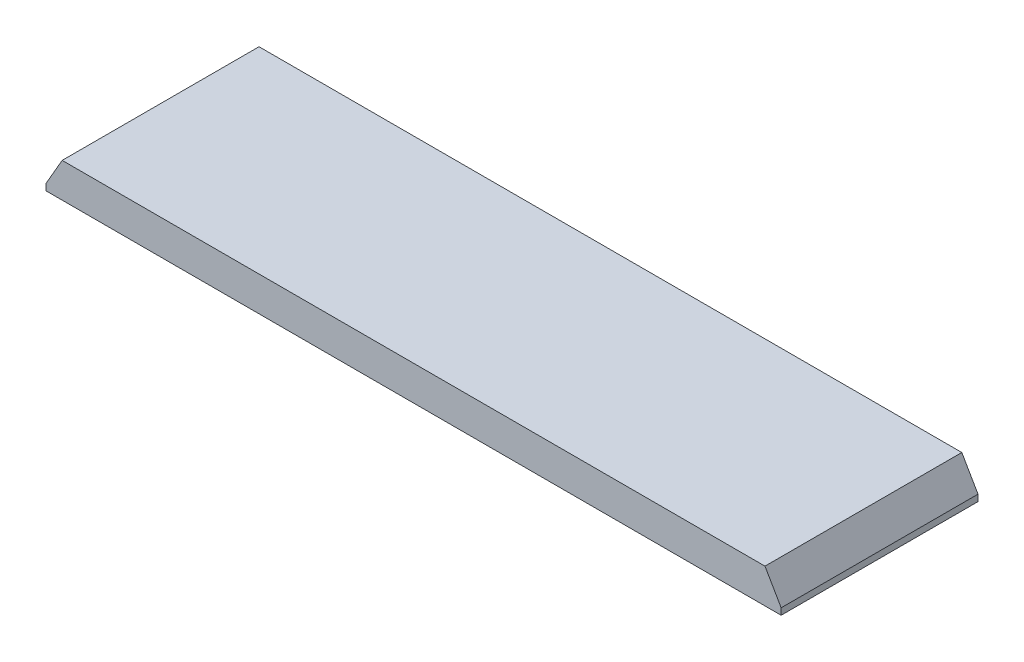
from build123d import *
from OCP.BRepFilletAPI import BRepFilletAPI_MakeChamfer

# Parameters (mm, degrees)
SKETCH3_W           = 1083.083
SKETCH3_H           = 290
BOSS_EXTRUDE1_DEPTH = 50.8
CHAMFER1_SIZE       = 41.275
CHAMFER1_SIZE2      = 23.830132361


with BuildPart() as part:
    # Sketch3 → Boss-Extrude1 (new body)
    with BuildSketch(Plane(origin=(0, 0, 0), x_dir=(-1, 0, 0), z_dir=(0, 1, 0))):
        Rectangle(SKETCH3_W, SKETCH3_H)
    extrude(amount=BOSS_EXTRUDE1_DEPTH)

    # Chamfer1: one chamfer whose edges measure the first distance from different faces: ONE call of the kernel's chamfer builder (chamfer() names one face for all edges)
    chamfer1_edges_1 = [part.edges().sort_by_distance(p)[0] for p in [
        (-541.5415, 50.8, 0),
    ]]
    chamfer1_side_1 = [part.faces().sort_by_distance(p)[0] for p in [
        (-541.5415, 25.4, 0),
    ]]
    chamfer1_edges_2 = [part.edges().sort_by_distance(p)[0] for p in [
        (541.5415, 50.8, 0),
    ]]
    chamfer1_side_2 = [part.faces().sort_by_distance(p)[0] for p in [
        (541.5415, 25.4, 0),
    ]]
    chamfer1 = BRepFilletAPI_MakeChamfer(part.part.solid().wrapped)
    for e in chamfer1_edges_1:
        chamfer1.Add(CHAMFER1_SIZE, CHAMFER1_SIZE2, e.wrapped, chamfer1_side_1[0].wrapped)  # the first distance lies on this face
    for e in chamfer1_edges_2:
        chamfer1.Add(CHAMFER1_SIZE, CHAMFER1_SIZE2, e.wrapped, chamfer1_side_2[0].wrapped)  # the first distance lies on this face
    add(Compound.cast(chamfer1.Shape()), mode=Mode.REPLACE)


solid = part.part
